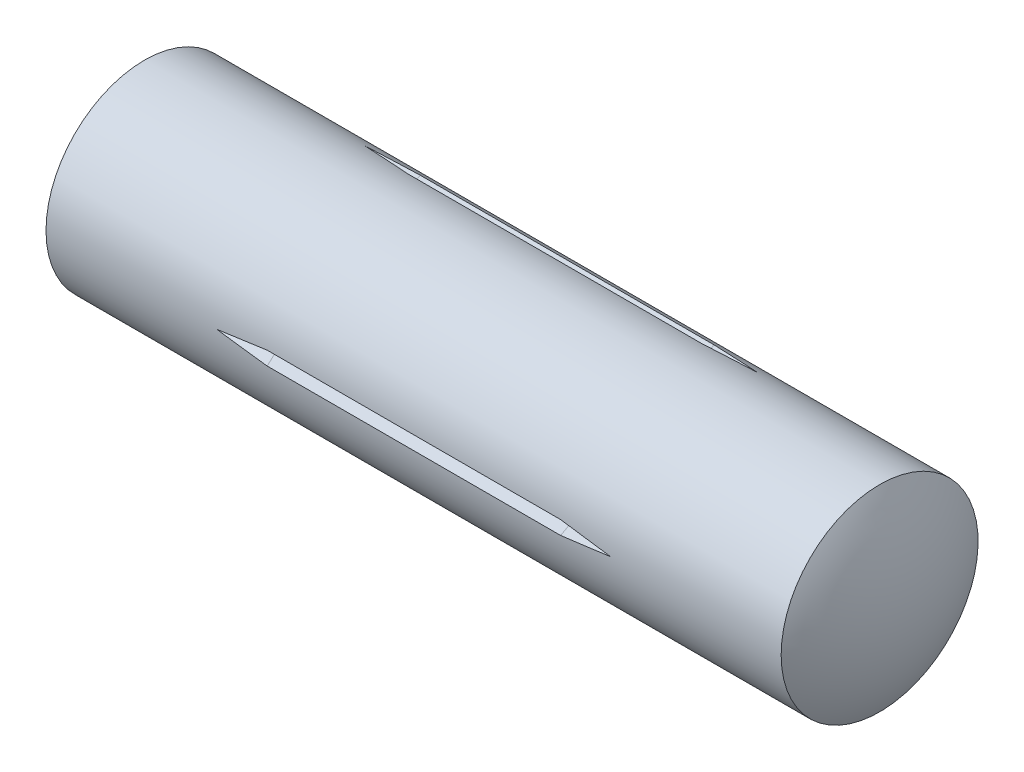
ISO-10303-21;
HEADER;
FILE_DESCRIPTION(('STEP AP214'),'2;1');
FILE_NAME('part.step','',(''),(''),'','','');
FILE_SCHEMA(('AUTOMOTIVE_DESIGN { 1 0 10303 214 1 1 1 1 }'));
ENDSEC;
DATA;
#1=APPLICATION_CONTEXT('core data for automotive mechanical design processes');
#2=APPLICATION_PROTOCOL_DEFINITION('international standard','automotive_design',2000,#1);
#3=PRODUCT_CONTEXT('',#1,'mechanical');
#4=PRODUCT('Part','Part','',(#3));
#5=PRODUCT_RELATED_PRODUCT_CATEGORY('part','',(#4));
#6=PRODUCT_DEFINITION_FORMATION('','',#4);
#7=PRODUCT_DEFINITION_CONTEXT('part definition',#1,'design');
#8=PRODUCT_DEFINITION('design','',#6,#7);
#9=PRODUCT_DEFINITION_SHAPE('','',#8);
#10=(LENGTH_UNIT() NAMED_UNIT(*) SI_UNIT(.MILLI.,.METRE.));
#11=(NAMED_UNIT(*) PLANE_ANGLE_UNIT() SI_UNIT($,.RADIAN.));
#12=(NAMED_UNIT(*) SI_UNIT($,.STERADIAN.) SOLID_ANGLE_UNIT());
#13=UNCERTAINTY_MEASURE_WITH_UNIT(LENGTH_MEASURE(1.E-05),#10,'distance_accuracy_value','');
#14=(GEOMETRIC_REPRESENTATION_CONTEXT(3) GLOBAL_UNCERTAINTY_ASSIGNED_CONTEXT((#13)) GLOBAL_UNIT_ASSIGNED_CONTEXT((#10,
#11,#12)) REPRESENTATION_CONTEXT('',''));
#15=CARTESIAN_POINT('',(0.,0.,0.));
#16=DIRECTION('',(0.,0.,1.));
#17=DIRECTION('',(1.,0.,0.));
#18=AXIS2_PLACEMENT_3D('',#15,#16,#17);
#19=CARTESIAN_POINT('',(-57.,0.,0.));
#20=DIRECTION('',(-1.,0.,0.));
#21=DIRECTION('',(0.,0.,1.));
#22=AXIS2_PLACEMENT_3D('',#19,#20,#21);
#23=CYLINDRICAL_SURFACE('',#22,12.5);
#24=CARTESIAN_POINT('',(-37.4999999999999,0.,0.));
#25=DIRECTION('',(-0.113967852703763,-0.0865878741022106,-0.989703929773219));
#26=DIRECTION('',(-0.993484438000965,0.00993295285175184,0.11353417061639));
#27=AXIS2_PLACEMENT_3D('',#24,#25,#26);
#28=ELLIPSE('',#27,109.68005190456,12.5);
#29=CARTESIAN_POINT('',(25.,-10.8253175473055,-6.25000000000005));
#30=VERTEX_POINT('',#29);
#31=CARTESIAN_POINT('',(18.6292333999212,-11.2344625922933,-5.48058849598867));
#32=VERTEX_POINT('',#31);
#33=EDGE_CURVE('E240',#30,#32,#28,.T.);
#34=ORIENTED_EDGE('',*,*,#33,.F.);
#35=CARTESIAN_POINT('',(-37.4999999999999,0.,0.));
#36=DIRECTION('',(-0.113967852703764,-0.900402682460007,0.419864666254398));
#37=DIRECTION('',(-0.993484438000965,0.103289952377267,-0.0481648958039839));
#38=AXIS2_PLACEMENT_3D('',#35,#36,#37);
#39=ELLIPSE('',#38,109.68005190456,12.5);
#40=CARTESIAN_POINT('',(18.6292333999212,-10.3635601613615,-6.9890357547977));
#41=VERTEX_POINT('',#40);
#42=EDGE_CURVE('E232',#41,#30,#39,.T.);
#43=ORIENTED_EDGE('',*,*,#42,.F.);
#44=DIRECTION('',(-1.,0.,0.));
#45=VECTOR('',#44,1.);
#46=CARTESIAN_POINT('',(-57.,-10.3635601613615,-6.9890357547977));
#47=LINE('',#46,#45);
#48=CARTESIAN_POINT('',(-18.6292333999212,-10.3635601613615,-6.98903575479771));
#49=VERTEX_POINT('',#48);
#50=EDGE_CURVE('E230',#41,#49,#47,.T.);
#51=ORIENTED_EDGE('',*,*,#50,.T.);
#52=CARTESIAN_POINT('',(37.4999999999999,0.,0.));
#53=DIRECTION('',(0.113967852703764,-0.900402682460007,0.419864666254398));
#54=DIRECTION('',(-0.993484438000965,-0.103289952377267,0.0481648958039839));
#55=AXIS2_PLACEMENT_3D('',#52,#53,#54);
#56=ELLIPSE('',#55,109.68005190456,12.5);
#57=CARTESIAN_POINT('',(-25.,-10.8253175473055,-6.25000000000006));
#58=VERTEX_POINT('',#57);
#59=EDGE_CURVE('E224',#58,#49,#56,.T.);
#60=ORIENTED_EDGE('',*,*,#59,.F.);
#61=CARTESIAN_POINT('',(37.4999999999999,0.,0.));
#62=DIRECTION('',(0.113967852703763,-0.0865878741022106,-0.989703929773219));
#63=DIRECTION('',(-0.993484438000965,-0.00993295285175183,-0.11353417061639));
#64=AXIS2_PLACEMENT_3D('',#61,#62,#63);
#65=ELLIPSE('',#64,109.68005190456,12.5);
#66=CARTESIAN_POINT('',(-18.6292333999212,-11.2344625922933,-5.48058849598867));
#67=VERTEX_POINT('',#66);
#68=EDGE_CURVE('E227',#67,#58,#65,.T.);
#69=ORIENTED_EDGE('',*,*,#68,.F.);
#70=DIRECTION('',(-1.,0.,0.));
#71=VECTOR('',#70,1.);
#72=CARTESIAN_POINT('',(-57.,-11.2344625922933,-5.48058849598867));
#73=LINE('',#72,#71);
#74=EDGE_CURVE('E235',#67,#32,#73,.F.);
#75=ORIENTED_EDGE('',*,*,#74,.T.);
#76=EDGE_LOOP('',(#34,#43,#51,#60,#69,#75));
#77=FACE_BOUND('',#76,.T.);
#78=CARTESIAN_POINT('',(46.6506350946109,0.,0.));
#79=DIRECTION('',(-1.,0.,0.));
#80=DIRECTION('',(0.,0.,1.));
#81=AXIS2_PLACEMENT_3D('',#78,#79,#80);
#82=CIRCLE('',#81,12.5);
#83=CARTESIAN_POINT('',(46.6506350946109,0.,12.5));
#84=VERTEX_POINT('',#83);
#85=EDGE_CURVE('E202',#84,#84,#82,.T.);
#86=ORIENTED_EDGE('',*,*,#85,.T.);
#87=EDGE_LOOP('',(#86));
#88=FACE_BOUND('',#87,.T.);
#89=CARTESIAN_POINT('',(-46.6819046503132,0.,0.));
#90=DIRECTION('',(-1.,0.,0.));
#91=DIRECTION('',(0.,0.,1.));
#92=AXIS2_PLACEMENT_3D('',#89,#90,#91);
#93=CIRCLE('',#92,12.5);
#94=CARTESIAN_POINT('',(-46.6819046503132,12.5,0.));
#95=VERTEX_POINT('',#94);
#96=EDGE_CURVE('E203',#95,#95,#93,.T.);
#97=ORIENTED_EDGE('',*,*,#96,.F.);
#98=EDGE_LOOP('',(#97));
#99=FACE_BOUND('',#98,.T.);
#100=CARTESIAN_POINT('',(-37.4999999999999,0.,0.));
#101=DIRECTION('',(-0.113967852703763,-0.81381480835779,0.569839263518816));
#102=DIRECTION('',(-0.993484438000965,0.0933569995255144,-0.0653692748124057));
#103=AXIS2_PLACEMENT_3D('',#100,#101,#102);
#104=ELLIPSE('',#103,109.68005190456,12.5);
#105=CARTESIAN_POINT('',(25.,0.,12.5));
#106=VERTEX_POINT('',#105);
#107=CARTESIAN_POINT('',(18.6292333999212,0.87090243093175,12.4696242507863));
#108=VERTEX_POINT('',#107);
#109=EDGE_CURVE('E221',#106,#108,#104,.T.);
#110=ORIENTED_EDGE('',*,*,#109,.F.);
#111=CARTESIAN_POINT('',(-37.4999999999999,0.,0.));
#112=DIRECTION('',(-0.113967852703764,0.81381480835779,0.569839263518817));
#113=DIRECTION('',(-0.993484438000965,-0.0933569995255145,-0.0653692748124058));
#114=AXIS2_PLACEMENT_3D('',#111,#112,#113);
#115=ELLIPSE('',#114,109.68005190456,12.5);
#116=CARTESIAN_POINT('',(18.6292333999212,-0.870902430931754,12.4696242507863));
#117=VERTEX_POINT('',#116);
#118=EDGE_CURVE('E223',#117,#106,#115,.T.);
#119=ORIENTED_EDGE('',*,*,#118,.F.);
#120=DIRECTION('',(-1.,0.,0.));
#121=VECTOR('',#120,1.);
#122=CARTESIAN_POINT('',(-57.,-0.870902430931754,12.4696242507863));
#123=LINE('',#122,#121);
#124=CARTESIAN_POINT('',(-18.6292333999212,-0.870902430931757,12.4696242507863));
#125=VERTEX_POINT('',#124);
#126=EDGE_CURVE('E215',#117,#125,#123,.T.);
#127=ORIENTED_EDGE('',*,*,#126,.T.);
#128=CARTESIAN_POINT('',(37.4999999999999,0.,0.));
#129=DIRECTION('',(0.113967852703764,0.813814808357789,0.569839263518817));
#130=DIRECTION('',(-0.993484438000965,0.0933569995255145,0.0653692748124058));
#131=AXIS2_PLACEMENT_3D('',#128,#129,#130);
#132=ELLIPSE('',#131,109.68005190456,12.5);
#133=CARTESIAN_POINT('',(-25.,0.,12.5));
#134=VERTEX_POINT('',#133);
#135=EDGE_CURVE('E208',#134,#125,#132,.T.);
#136=ORIENTED_EDGE('',*,*,#135,.F.);
#137=CARTESIAN_POINT('',(37.4999999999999,0.,0.));
#138=DIRECTION('',(0.113967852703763,-0.81381480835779,0.569839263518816));
#139=DIRECTION('',(-0.993484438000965,-0.0933569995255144,0.0653692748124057));
#140=AXIS2_PLACEMENT_3D('',#137,#138,#139);
#141=ELLIPSE('',#140,109.68005190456,12.5);
#142=CARTESIAN_POINT('',(-18.6292333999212,0.87090243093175,12.4696242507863));
#143=VERTEX_POINT('',#142);
#144=EDGE_CURVE('E212',#143,#134,#141,.T.);
#145=ORIENTED_EDGE('',*,*,#144,.F.);
#146=DIRECTION('',(-1.,0.,0.));
#147=VECTOR('',#146,1.);
#148=CARTESIAN_POINT('',(-57.,0.870902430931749,12.4696242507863));
#149=LINE('',#148,#147);
#150=EDGE_CURVE('E220',#143,#108,#149,.F.);
#151=ORIENTED_EDGE('',*,*,#150,.T.);
#152=EDGE_LOOP('',(#110,#119,#127,#136,#145,#151));
#153=FACE_BOUND('',#152,.T.);
#154=CARTESIAN_POINT('',(-37.4999999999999,0.,0.));
#155=DIRECTION('',(-0.113967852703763,0.900402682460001,0.419864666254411));
#156=DIRECTION('',(-0.993484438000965,-0.103289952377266,-0.0481648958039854));
#157=AXIS2_PLACEMENT_3D('',#154,#155,#156);
#158=ELLIPSE('',#157,109.68005190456,12.5);
#159=CARTESIAN_POINT('',(25.,10.8253175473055,-6.2499999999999));
#160=VERTEX_POINT('',#159);
#161=CARTESIAN_POINT('',(18.6292333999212,10.3635601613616,-6.98903575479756));
#162=VERTEX_POINT('',#161);
#163=EDGE_CURVE('E12',#160,#162,#158,.T.);
#164=ORIENTED_EDGE('',*,*,#163,.F.);
#165=CARTESIAN_POINT('',(-37.4999999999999,0.,0.));
#166=DIRECTION('',(-0.113967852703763,0.086587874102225,-0.989703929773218));
#167=DIRECTION('',(-0.993484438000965,-0.00993295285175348,0.11353417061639));
#168=AXIS2_PLACEMENT_3D('',#165,#166,#167);
#169=ELLIPSE('',#168,109.68005190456,12.5);
#170=CARTESIAN_POINT('',(18.6292333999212,11.2344625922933,-5.48058849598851));
#171=VERTEX_POINT('',#170);
#172=EDGE_CURVE('E52',#171,#160,#169,.T.);
#173=ORIENTED_EDGE('',*,*,#172,.F.);
#174=DIRECTION('',(-1.,0.,0.));
#175=VECTOR('',#174,1.);
#176=CARTESIAN_POINT('',(-57.,11.2344625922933,-5.48058849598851));
#177=LINE('',#176,#175);
#178=CARTESIAN_POINT('',(-18.6292333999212,11.2344625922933,-5.48058849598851));
#179=VERTEX_POINT('',#178);
#180=EDGE_CURVE('E241',#171,#179,#177,.T.);
#181=ORIENTED_EDGE('',*,*,#180,.T.);
#182=CARTESIAN_POINT('',(37.5,0.,0.));
#183=DIRECTION('',(0.113967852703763,0.086587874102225,-0.989703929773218));
#184=DIRECTION('',(-0.993484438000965,0.00993295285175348,-0.11353417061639));
#185=AXIS2_PLACEMENT_3D('',#182,#183,#184);
#186=ELLIPSE('',#185,109.68005190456,12.5);
#187=CARTESIAN_POINT('',(-25.,10.8253175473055,-6.2499999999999));
#188=VERTEX_POINT('',#187);
#189=EDGE_CURVE('E133',#188,#179,#186,.T.);
#190=ORIENTED_EDGE('',*,*,#189,.F.);
#191=CARTESIAN_POINT('',(37.4999999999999,0.,0.));
#192=DIRECTION('',(0.113967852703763,0.900402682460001,0.419864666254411));
#193=DIRECTION('',(-0.993484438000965,0.103289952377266,0.0481648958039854));
#194=AXIS2_PLACEMENT_3D('',#191,#192,#193);
#195=ELLIPSE('',#194,109.68005190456,12.5);
#196=CARTESIAN_POINT('',(-18.6292333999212,10.3635601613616,-6.98903575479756));
#197=VERTEX_POINT('',#196);
#198=EDGE_CURVE('E157',#197,#188,#195,.T.);
#199=ORIENTED_EDGE('',*,*,#198,.F.);
#200=DIRECTION('',(-1.,0.,0.));
#201=VECTOR('',#200,1.);
#202=CARTESIAN_POINT('',(-57.,10.3635601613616,-6.98903575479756));
#203=LINE('',#202,#201);
#204=EDGE_CURVE('E151',#197,#162,#203,.F.);
#205=ORIENTED_EDGE('',*,*,#204,.T.);
#206=EDGE_LOOP('',(#164,#173,#181,#190,#199,#205));
#207=FACE_BOUND('',#206,.T.);
#208=ADVANCED_FACE('F44',(#77,#88,#99,#153,#207),#23,.T.);
#209=CARTESIAN_POINT('',(-25.0312695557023,0.,0.));
#210=DIRECTION('',(-1.,0.,0.));
#211=DIRECTION('',(0.,1.,0.));
#212=AXIS2_PLACEMENT_3D('',#209,#210,#211);
#213=SPHERICAL_SURFACE('',#212,25.);
#214=CARTESIAN_POINT('',(-50.,0.,0.));
#215=DIRECTION('',(-1.,0.,0.));
#216=DIRECTION('',(0.,0.,1.));
#217=AXIS2_PLACEMENT_3D('',#214,#215,#216);
#218=CIRCLE('',#217,1.25);
#219=CARTESIAN_POINT('',(-50.,1.25000000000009,0.));
#220=VERTEX_POINT('',#219);
#221=EDGE_CURVE('E210',#220,#220,#218,.T.);
#222=CARTESIAN_POINT('',(-50.,1.25000000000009,0.));
#223=CARTESIAN_POINT('',(-49.9938336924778,1.37317333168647,0.));
#224=CARTESIAN_POINT('',(-49.9867558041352,1.49630102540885,0.));
#225=CARTESIAN_POINT('',(-49.9707787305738,1.74243819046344,0.));
#226=CARTESIAN_POINT('',(-49.9618795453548,1.86544766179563,0.));
#227=CARTESIAN_POINT('',(-49.942261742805,2.11132143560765,0.));
#228=CARTESIAN_POINT('',(-49.931543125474,2.23418573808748,0.));
#229=CARTESIAN_POINT('',(-49.9082888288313,2.47974226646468,0.));
#230=CARTESIAN_POINT('',(-49.8957531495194,2.60243449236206,0.));
#231=CARTESIAN_POINT('',(-49.8688674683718,2.84761999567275,0.));
#232=CARTESIAN_POINT('',(-49.854517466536,2.97011327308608,0.));
#233=CARTESIAN_POINT('',(-49.8240062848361,3.21487405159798,0.));
#234=CARTESIAN_POINT('',(-49.8078451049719,3.33714155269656,0.));
#235=CARTESIAN_POINT('',(-49.7737151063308,3.58142400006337,0.));
#236=CARTESIAN_POINT('',(-49.7557462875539,3.70343894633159,0.));
#237=CARTESIAN_POINT('',(-49.718004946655,3.94718956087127,0.));
#238=CARTESIAN_POINT('',(-49.698232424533,4.06892522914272,0.));
#239=CARTESIAN_POINT('',(-49.6568880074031,4.31209062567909,0.));
#240=CARTESIAN_POINT('',(-49.6353161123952,4.433520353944,0.));
#241=CARTESIAN_POINT('',(-49.5903776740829,4.67604727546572,0.));
#242=CARTESIAN_POINT('',(-49.5670111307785,4.79714446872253,0.));
#243=CARTESIAN_POINT('',(-49.5184885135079,5.03897979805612,0.));
#244=CARTESIAN_POINT('',(-49.4933324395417,5.15971793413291,0.));
#245=CARTESIAN_POINT('',(-49.4412362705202,5.40080870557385,0.));
#246=CARTESIAN_POINT('',(-49.414296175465,5.521161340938,0.));
#247=CARTESIAN_POINT('',(-49.3586378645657,5.76145475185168,0.));
#248=CARTESIAN_POINT('',(-49.3299196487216,5.8813955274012,0.));
#249=CARTESIAN_POINT('',(-49.2707113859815,6.12083894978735,0.));
#250=CARTESIAN_POINT('',(-49.2402213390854,6.24034159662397,0.));
#251=CARTESIAN_POINT('',(-49.1774760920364,6.47888258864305,0.));
#252=CARTESIAN_POINT('',(-49.1452208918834,6.59792093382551,0.));
#253=CARTESIAN_POINT('',(-49.078952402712,6.83550725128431,0.));
#254=CARTESIAN_POINT('',(-49.0449391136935,6.95405522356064,0.));
#255=CARTESIAN_POINT('',(-48.9751618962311,7.19063483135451,0.));
#256=CARTESIAN_POINT('',(-48.9393979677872,7.30866646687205,0.));
#257=CARTESIAN_POINT('',(-48.8661273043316,7.54418755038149,0.));
#258=CARTESIAN_POINT('',(-48.8286205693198,7.66167699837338,0.));
#259=CARTESIAN_POINT('',(-48.7518725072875,7.89608797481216,0.));
#260=CARTESIAN_POINT('',(-48.712631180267,8.01300950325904,0.));
#261=CARTESIAN_POINT('',(-48.6324225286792,8.24625903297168,0.));
#262=CARTESIAN_POINT('',(-48.5914552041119,8.36258703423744,0.));
#263=CARTESIAN_POINT('',(-48.5078035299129,8.59462403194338,0.));
#264=CARTESIAN_POINT('',(-48.4651191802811,8.71033302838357,0.));
#265=CARTESIAN_POINT('',(-48.3780428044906,8.94110667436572,0.));
#266=CARTESIAN_POINT('',(-48.3336507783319,9.05617132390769,0.));
#267=CARTESIAN_POINT('',(-48.2431687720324,9.28563107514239,0.));
#268=CARTESIAN_POINT('',(-48.1970787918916,9.40002617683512,0.));
#269=CARTESIAN_POINT('',(-48.1032109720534,9.62812177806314,0.));
#270=CARTESIAN_POINT('',(-48.055433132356,9.74182227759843,0.));
#271=CARTESIAN_POINT('',(-47.9582000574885,9.96850377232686,0.));
#272=CARTESIAN_POINT('',(-47.9087448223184,10.08148476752,0.));
#273=CARTESIAN_POINT('',(-47.8081677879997,10.3067025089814,0.));
#274=CARTESIAN_POINT('',(-47.7570459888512,10.4189392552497,0.));
#275=CARTESIAN_POINT('',(-47.653147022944,10.6426439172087,0.));
#276=CARTESIAN_POINT('',(-47.6003698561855,10.7541118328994,0.));
#277=CARTESIAN_POINT('',(-47.4931717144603,10.9762544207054,0.));
#278=CARTESIAN_POINT('',(-47.4387507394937,11.0869290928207,0.));
#279=CARTESIAN_POINT('',(-47.3282768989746,11.307460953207,0.));
#280=CARTESIAN_POINT('',(-47.272224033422,11.417318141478,0.));
#281=CARTESIAN_POINT('',(-47.1584986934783,11.6361909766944,0.));
#282=CARTESIAN_POINT('',(-47.1008262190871,11.7452066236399,0.));
#283=CARTESIAN_POINT('',(-46.9838742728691,11.9623724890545,0.));
#284=CARTESIAN_POINT('',(-46.9245948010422,12.0705227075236,0.));
#285=CARTESIAN_POINT('',(-46.8044419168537,12.2859340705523,0.));
#286=CARTESIAN_POINT('',(-46.743568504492,12.3931952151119,0.));
#287=CARTESIAN_POINT('',(-46.6819046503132,12.5,0.));
#288=B_SPLINE_CURVE_WITH_KNOTS('',3,(#222,#223,#224,#225,#226,#227,#228,#229,#230,#231,#232,
#233,#234,#235,#236,#237,#238,#239,#240,#241,#242,#243,#244,#245,#246,#247,#248,#249,#250,#251,
#252,#253,#254,#255,#256,#257,#258,#259,#260,#261,#262,#263,#264,#265,#266,#267,#268,#269,#270,
#271,#272,#273,#274,#275,#276,#277,#278,#279,#280,#281,#282,#283,#284,#285,#286,#287),
.UNSPECIFIED.,.F.,.F.,(4,2,2,2,2,2,2,2,2,2,2,2,2,2,2,2,2,2,2,2,2,2,2,2,2,2,2,2,2,2,2,2,4),(0.,
0.369979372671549,0.739958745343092,1.10993811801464,1.47991749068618,1.84989686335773,
2.21987623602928,2.58985560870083,2.95983498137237,3.32981435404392,3.69979372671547,
4.06977309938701,4.43975247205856,4.8097318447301,5.17971121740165,5.5496905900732,
5.91966996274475,6.28964933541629,6.65962870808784,7.02960808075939,7.39958745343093,
7.76956682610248,8.13954619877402,8.50952557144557,8.87950494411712,9.24948431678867,
9.61946368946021,9.98944306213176,10.3594224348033,10.7294018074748,11.0993811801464,
11.4693605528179,11.8393399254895),.UNSPECIFIED.);
#289=EDGE_CURVE('BSEAM50',#220,#95,#288,.T.);
#290=ORIENTED_EDGE('',*,*,#221,.F.);
#291=ORIENTED_EDGE('',*,*,#96,.T.);
#292=ORIENTED_EDGE('',*,*,#289,.T.);
#293=ORIENTED_EDGE('',*,*,#289,.F.);
#294=EDGE_LOOP('',(#290,#292,#291,#293));
#295=FACE_BOUND('',#294,.T.);
#296=ADVANCED_FACE('F50',(#295),#213,.T.);
#297=CARTESIAN_POINT('',(-50.,0.,0.));
#298=DIRECTION('',(1.,0.,0.));
#299=DIRECTION('',(0.,0.,-1.));
#300=AXIS2_PLACEMENT_3D('',#297,#298,#299);
#301=PLANE('',#300);
#302=ORIENTED_EDGE('',*,*,#221,.T.);
#303=EDGE_LOOP('',(#302));
#304=FACE_BOUND('',#303,.T.);
#305=ADVANCED_FACE('F258',(#304),#301,.F.);
#306=CARTESIAN_POINT('',(25.,0.,0.));
#307=DIRECTION('',(-1.,0.,0.));
#308=DIRECTION('',(0.,1.,0.));
#309=AXIS2_PLACEMENT_3D('',#306,#307,#308);
#310=SPHERICAL_SURFACE('',#309,25.);
#311=ORIENTED_EDGE('',*,*,#85,.F.);
#312=EDGE_LOOP('',(#311));
#313=FACE_BOUND('',#312,.T.);
#314=ADVANCED_FACE('F270',(#313),#310,.T.);
#315=CARTESIAN_POINT('',(18.5292343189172,1.59204091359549,13.4795169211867));
#316=DIRECTION('',(-0.113967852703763,-0.81381480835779,0.569839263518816));
#317=DIRECTION('',(0.,-0.573576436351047,-0.819152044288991));
#318=AXIS2_PLACEMENT_3D('',#315,#316,#317);
#319=PLANE('',#318);
#320=ORIENTED_EDGE('',*,*,#109,.T.);
#321=DIRECTION('',(0.0803231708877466,-0.579246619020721,-0.811185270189));
#322=VECTOR('',#321,1.);
#323=CARTESIAN_POINT('',(18.5292343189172,1.59204091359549,13.4795169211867));
#324=LINE('',#323,#322);
#325=CARTESIAN_POINT('',(18.75,0.,11.25));
#326=VERTEX_POINT('',#325);
#327=EDGE_CURVE('E189',#108,#326,#324,.T.);
#328=ORIENTED_EDGE('',*,*,#327,.T.);
#329=DIRECTION('',(0.98058067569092,0.,0.196116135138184));
#330=VECTOR('',#329,1.);
#331=CARTESIAN_POINT('',(18.75,0.,11.25));
#332=LINE('',#331,#330);
#333=EDGE_CURVE('E190',#326,#106,#332,.T.);
#334=ORIENTED_EDGE('',*,*,#333,.T.);
#335=EDGE_LOOP('',(#320,#328,#334));
#336=FACE_BOUND('',#335,.T.);
#337=ADVANCED_FACE('F267',(#336),#319,.T.);
#338=CARTESIAN_POINT('',(18.5292343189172,-1.59204091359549,13.4795169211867));
#339=DIRECTION('',(-0.113967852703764,0.81381480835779,0.569839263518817));
#340=DIRECTION('',(0.,-0.573576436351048,0.819152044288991));
#341=AXIS2_PLACEMENT_3D('',#338,#339,#340);
#342=PLANE('',#341);
#343=ORIENTED_EDGE('',*,*,#118,.T.);
#344=ORIENTED_EDGE('',*,*,#333,.F.);
#345=DIRECTION('',(-0.0803231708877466,-0.579246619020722,0.811185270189));
#346=VECTOR('',#345,1.);
#347=CARTESIAN_POINT('',(18.5292343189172,-1.59204091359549,13.4795169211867));
#348=LINE('',#347,#346);
#349=EDGE_CURVE('E183',#326,#117,#348,.T.);
#350=ORIENTED_EDGE('',*,*,#349,.T.);
#351=EDGE_LOOP('',(#343,#344,#350));
#352=FACE_BOUND('',#351,.T.);
#353=ADVANCED_FACE('F263',(#352),#342,.T.);
#354=CARTESIAN_POINT('',(-18.7714540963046,-0.154715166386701,11.033334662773));
#355=DIRECTION('',(0.,0.81381480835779,-0.581124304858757));
#356=DIRECTION('',(0.,0.581124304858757,0.81381480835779));
#357=AXIS2_PLACEMENT_3D('',#354,#355,#356);
#358=PLANE('',#357);
#359=DIRECTION('',(0.0803231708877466,0.579246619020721,0.811185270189));
#360=VECTOR('',#359,1.);
#361=CARTESIAN_POINT('',(-18.7714540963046,-0.154715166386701,11.033334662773));
#362=LINE('',#361,#360);
#363=CARTESIAN_POINT('',(-18.75,0.,11.25));
#364=VERTEX_POINT('',#363);
#365=EDGE_CURVE('E191',#364,#143,#362,.T.);
#366=ORIENTED_EDGE('',*,*,#365,.F.);
#367=DIRECTION('',(1.,0.,0.));
#368=VECTOR('',#367,1.);
#369=CARTESIAN_POINT('',(-18.75,0.,11.25));
#370=LINE('',#369,#368);
#371=EDGE_CURVE('E188',#364,#326,#370,.T.);
#372=ORIENTED_EDGE('',*,*,#371,.T.);
#373=ORIENTED_EDGE('',*,*,#327,.F.);
#374=ORIENTED_EDGE('',*,*,#150,.F.);
#375=EDGE_LOOP('',(#366,#372,#373,#374));
#376=FACE_BOUND('',#375,.T.);
#377=ADVANCED_FACE('F286',(#376),#358,.F.);
#378=CARTESIAN_POINT('',(-18.7714540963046,0.154715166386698,11.033334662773));
#379=DIRECTION('',(0.,-0.81381480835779,-0.581124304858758));
#380=DIRECTION('',(0.,0.581124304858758,-0.81381480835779));
#381=AXIS2_PLACEMENT_3D('',#378,#379,#380);
#382=PLANE('',#381);
#383=ORIENTED_EDGE('',*,*,#349,.F.);
#384=ORIENTED_EDGE('',*,*,#371,.F.);
#385=DIRECTION('',(-0.0803231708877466,0.579246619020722,-0.811185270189));
#386=VECTOR('',#385,1.);
#387=CARTESIAN_POINT('',(-18.7714540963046,0.154715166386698,11.033334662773));
#388=LINE('',#387,#386);
#389=EDGE_CURVE('E193',#125,#364,#388,.T.);
#390=ORIENTED_EDGE('',*,*,#389,.F.);
#391=ORIENTED_EDGE('',*,*,#126,.F.);
#392=EDGE_LOOP('',(#383,#384,#390,#391));
#393=FACE_BOUND('',#392,.T.);
#394=ADVANCED_FACE('F295',(#393),#382,.F.);
#395=CARTESIAN_POINT('',(-15.4892923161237,0.,10.5978584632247));
#396=DIRECTION('',(0.113967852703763,-0.81381480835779,0.569839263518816));
#397=DIRECTION('',(0.,-0.573576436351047,-0.819152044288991));
#398=AXIS2_PLACEMENT_3D('',#395,#396,#397);
#399=PLANE('',#398);
#400=ORIENTED_EDGE('',*,*,#144,.T.);
#401=DIRECTION('',(-0.98058067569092,0.,0.196116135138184));
#402=VECTOR('',#401,1.);
#403=CARTESIAN_POINT('',(-15.4892923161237,0.,10.5978584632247));
#404=LINE('',#403,#402);
#405=EDGE_CURVE('E182',#364,#134,#404,.T.);
#406=ORIENTED_EDGE('',*,*,#405,.F.);
#407=ORIENTED_EDGE('',*,*,#365,.T.);
#408=EDGE_LOOP('',(#400,#406,#407));
#409=FACE_BOUND('',#408,.T.);
#410=ADVANCED_FACE('F306',(#409),#399,.T.);
#411=CARTESIAN_POINT('',(-15.4892923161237,0.,10.5978584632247));
#412=DIRECTION('',(0.113967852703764,0.813814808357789,0.569839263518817));
#413=DIRECTION('',(0.,-0.573576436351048,0.819152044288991));
#414=AXIS2_PLACEMENT_3D('',#411,#412,#413);
#415=PLANE('',#414);
#416=ORIENTED_EDGE('',*,*,#135,.T.);
#417=ORIENTED_EDGE('',*,*,#389,.T.);
#418=ORIENTED_EDGE('',*,*,#405,.T.);
#419=EDGE_LOOP('',(#416,#417,#418));
#420=FACE_BOUND('',#419,.T.);
#421=ADVANCED_FACE('F308',(#420),#415,.T.);
#422=CARTESIAN_POINT('',(18.5295225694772,-12.466064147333,-5.36135527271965));
#423=DIRECTION('',(-0.113967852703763,-0.0865878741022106,-0.989703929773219));
#424=DIRECTION('',(-0.993435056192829,0.,0.114397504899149));
#425=AXIS2_PLACEMENT_3D('',#422,#423,#424);
#426=PLANE('',#425);
#427=ORIENTED_EDGE('',*,*,#33,.T.);
#428=DIRECTION('',(0.0803231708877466,0.992130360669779,-0.0960496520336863));
#429=VECTOR('',#428,1.);
#430=CARTESIAN_POINT('',(18.5295225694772,-12.466064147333,-5.36135527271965));
#431=LINE('',#430,#429);
#432=CARTESIAN_POINT('',(18.75,-9.74278579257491,-5.62500000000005));
#433=VERTEX_POINT('',#432);
#434=EDGE_CURVE('E167',#32,#433,#431,.T.);
#435=ORIENTED_EDGE('',*,*,#434,.T.);
#436=DIRECTION('',(0.98058067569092,-0.169841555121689,-0.0980580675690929));
#437=VECTOR('',#436,1.);
#438=CARTESIAN_POINT('',(18.75,-9.74278579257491,-5.62500000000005));
#439=LINE('',#438,#437);
#440=EDGE_CURVE('E169',#433,#30,#439,.T.);
#441=ORIENTED_EDGE('',*,*,#440,.T.);
#442=EDGE_LOOP('',(#427,#435,#441));
#443=FACE_BOUND('',#442,.T.);
#444=ADVANCED_FACE('F309',(#443),#426,.T.);
#445=CARTESIAN_POINT('',(18.5295225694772,-10.8761019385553,-8.11525060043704));
#446=DIRECTION('',(-0.113967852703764,-0.900402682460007,0.419864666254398));
#447=DIRECTION('',(0.,-0.422618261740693,-0.906307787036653));
#448=AXIS2_PLACEMENT_3D('',#445,#446,#447);
#449=PLANE('',#448);
#450=ORIENTED_EDGE('',*,*,#42,.T.);
#451=ORIENTED_EDGE('',*,*,#440,.F.);
#452=DIRECTION('',(-0.0803231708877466,-0.412883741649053,-0.907234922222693));
#453=VECTOR('',#452,1.);
#454=CARTESIAN_POINT('',(18.5295225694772,-10.8761019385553,-8.11525060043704));
#455=LINE('',#454,#453);
#456=EDGE_CURVE('E168',#433,#41,#455,.T.);
#457=ORIENTED_EDGE('',*,*,#456,.T.);
#458=EDGE_LOOP('',(#450,#451,#457));
#459=FACE_BOUND('',#458,.T.);
#460=ADVANCED_FACE('F314',(#459),#449,.T.);
#461=CARTESIAN_POINT('',(-18.7717461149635,-9.47418358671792,-5.65100378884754));
#462=DIRECTION('',(0.,0.0963610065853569,0.99534645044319));
#463=DIRECTION('',(0.,-0.99534645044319,0.0963610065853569));
#464=AXIS2_PLACEMENT_3D('',#461,#462,#463);
#465=PLANE('',#464);
#466=DIRECTION('',(0.0803231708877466,-0.992130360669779,0.0960496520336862));
#467=VECTOR('',#466,1.);
#468=CARTESIAN_POINT('',(-18.7717461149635,-9.47418358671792,-5.65100378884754));
#469=LINE('',#468,#467);
#470=CARTESIAN_POINT('',(-18.75,-9.74278579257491,-5.62500000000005));
#471=VERTEX_POINT('',#470);
#472=EDGE_CURVE('E173',#471,#67,#469,.T.);
#473=ORIENTED_EDGE('',*,*,#472,.F.);
#474=DIRECTION('',(1.,0.,0.));
#475=VECTOR('',#474,1.);
#476=CARTESIAN_POINT('',(-18.75,-9.74278579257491,-5.62500000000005));
#477=LINE('',#476,#475);
#478=EDGE_CURVE('E175',#471,#433,#477,.T.);
#479=ORIENTED_EDGE('',*,*,#478,.T.);
#480=ORIENTED_EDGE('',*,*,#434,.F.);
#481=ORIENTED_EDGE('',*,*,#74,.F.);
#482=EDGE_LOOP('',(#473,#479,#480,#481));
#483=FACE_BOUND('',#482,.T.);
#484=ADVANCED_FACE('F319',(#483),#465,.F.);
#485=CARTESIAN_POINT('',(-18.7717461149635,-9.63100463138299,-5.37938177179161));
#486=DIRECTION('',(0.,0.910175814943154,-0.414222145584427));
#487=DIRECTION('',(0.,0.414222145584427,0.910175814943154));
#488=AXIS2_PLACEMENT_3D('',#485,#486,#487);
#489=PLANE('',#488);
#490=ORIENTED_EDGE('',*,*,#456,.F.);
#491=ORIENTED_EDGE('',*,*,#478,.F.);
#492=DIRECTION('',(-0.0803231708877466,0.412883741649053,0.907234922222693));
#493=VECTOR('',#492,1.);
#494=CARTESIAN_POINT('',(-18.7717461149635,-9.63100463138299,-5.37938177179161));
#495=LINE('',#494,#493);
#496=EDGE_CURVE('E176',#49,#471,#495,.T.);
#497=ORIENTED_EDGE('',*,*,#496,.F.);
#498=ORIENTED_EDGE('',*,*,#50,.F.);
#499=EDGE_LOOP('',(#490,#491,#497,#498));
#500=FACE_BOUND('',#499,.T.);
#501=ADVANCED_FACE('F322',(#500),#489,.F.);
#502=CARTESIAN_POINT('',(-15.4449097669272,-9.17032737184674,-5.29449097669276));
#503=DIRECTION('',(0.113967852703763,-0.0865878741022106,-0.989703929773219));
#504=DIRECTION('',(-0.993435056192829,0.,-0.114397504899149));
#505=AXIS2_PLACEMENT_3D('',#502,#503,#504);
#506=PLANE('',#505);
#507=ORIENTED_EDGE('',*,*,#68,.T.);
#508=DIRECTION('',(-0.98058067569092,-0.169841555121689,-0.0980580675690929));
#509=VECTOR('',#508,1.);
#510=CARTESIAN_POINT('',(-15.4449097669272,-9.17032737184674,-5.29449097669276));
#511=LINE('',#510,#509);
#512=EDGE_CURVE('E70',#471,#58,#511,.T.);
#513=ORIENTED_EDGE('',*,*,#512,.F.);
#514=ORIENTED_EDGE('',*,*,#472,.T.);
#515=EDGE_LOOP('',(#507,#513,#514));
#516=FACE_BOUND('',#515,.T.);
#517=ADVANCED_FACE('F325',(#516),#506,.T.);
#518=CARTESIAN_POINT('',(-15.4449097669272,-9.17032737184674,-5.29449097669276));
#519=DIRECTION('',(0.113967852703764,-0.900402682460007,0.419864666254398));
#520=DIRECTION('',(0.,-0.422618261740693,-0.906307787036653));
#521=AXIS2_PLACEMENT_3D('',#518,#519,#520);
#522=PLANE('',#521);
#523=ORIENTED_EDGE('',*,*,#59,.T.);
#524=ORIENTED_EDGE('',*,*,#496,.T.);
#525=ORIENTED_EDGE('',*,*,#512,.T.);
#526=EDGE_LOOP('',(#523,#524,#525));
#527=FACE_BOUND('',#526,.T.);
#528=ADVANCED_FACE('F328',(#527),#522,.T.);
#529=CARTESIAN_POINT('',(18.5295225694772,10.8761019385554,-8.11525060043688));
#530=DIRECTION('',(-0.113967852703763,0.900402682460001,0.419864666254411));
#531=DIRECTION('',(0.,-0.422618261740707,0.906307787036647));
#532=AXIS2_PLACEMENT_3D('',#529,#530,#531);
#533=PLANE('',#532);
#534=ORIENTED_EDGE('',*,*,#163,.T.);
#535=DIRECTION('',(0.0803231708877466,-0.412883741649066,0.907234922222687));
#536=VECTOR('',#535,1.);
#537=CARTESIAN_POINT('',(18.5295225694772,10.8761019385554,-8.11525060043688));
#538=LINE('',#537,#536);
#539=CARTESIAN_POINT('',(18.75,9.74278579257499,-5.62499999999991));
#540=VERTEX_POINT('',#539);
#541=EDGE_CURVE('E148',#162,#540,#538,.T.);
#542=ORIENTED_EDGE('',*,*,#541,.T.);
#543=DIRECTION('',(0.98058067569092,0.16984155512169,-0.0980580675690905));
#544=VECTOR('',#543,1.);
#545=CARTESIAN_POINT('',(18.75,9.74278579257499,-5.62499999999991));
#546=LINE('',#545,#544);
#547=EDGE_CURVE('E161',#540,#160,#546,.T.);
#548=ORIENTED_EDGE('',*,*,#547,.T.);
#549=EDGE_LOOP('',(#534,#542,#548));
#550=FACE_BOUND('',#549,.T.);
#551=ADVANCED_FACE('F249',(#550),#533,.T.);
#552=CARTESIAN_POINT('',(18.5295225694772,12.4660641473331,-5.36135527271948));
#553=DIRECTION('',(-0.113967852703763,0.086587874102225,-0.989703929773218));
#554=DIRECTION('',(-0.993435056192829,0.,0.11439750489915));
#555=AXIS2_PLACEMENT_3D('',#552,#553,#554);
#556=PLANE('',#555);
#557=ORIENTED_EDGE('',*,*,#172,.T.);
#558=ORIENTED_EDGE('',*,*,#547,.F.);
#559=DIRECTION('',(-0.0803231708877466,0.992130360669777,0.0960496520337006));
#560=VECTOR('',#559,1.);
#561=CARTESIAN_POINT('',(18.5295225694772,12.4660641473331,-5.36135527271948));
#562=LINE('',#561,#560);
#563=EDGE_CURVE('E146',#540,#171,#562,.T.);
#564=ORIENTED_EDGE('',*,*,#563,.T.);
#565=EDGE_LOOP('',(#557,#558,#564));
#566=FACE_BOUND('',#565,.T.);
#567=ADVANCED_FACE('F246',(#566),#556,.T.);
#568=CARTESIAN_POINT('',(-18.7717461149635,9.63100463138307,-5.37938177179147));
#569=DIRECTION('',(0.,-0.910175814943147,-0.41422214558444));
#570=DIRECTION('',(0.,0.41422214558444,-0.910175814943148));
#571=AXIS2_PLACEMENT_3D('',#568,#569,#570);
#572=PLANE('',#571);
#573=DIRECTION('',(0.0803231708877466,0.412883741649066,-0.907234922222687));
#574=VECTOR('',#573,1.);
#575=CARTESIAN_POINT('',(-18.7717461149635,9.63100463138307,-5.37938177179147));
#576=LINE('',#575,#574);
#577=CARTESIAN_POINT('',(-18.75,9.74278579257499,-5.62499999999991));
#578=VERTEX_POINT('',#577);
#579=EDGE_CURVE('E137',#578,#197,#576,.T.);
#580=ORIENTED_EDGE('',*,*,#579,.F.);
#581=DIRECTION('',(1.,0.,0.));
#582=VECTOR('',#581,1.);
#583=CARTESIAN_POINT('',(-18.75,9.74278579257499,-5.62499999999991));
#584=LINE('',#583,#582);
#585=EDGE_CURVE('E136',#578,#540,#584,.T.);
#586=ORIENTED_EDGE('',*,*,#585,.T.);
#587=ORIENTED_EDGE('',*,*,#541,.F.);
#588=ORIENTED_EDGE('',*,*,#204,.F.);
#589=EDGE_LOOP('',(#580,#586,#587,#588));
#590=FACE_BOUND('',#589,.T.);
#591=ADVANCED_FACE('F154',(#590),#572,.F.);
#592=CARTESIAN_POINT('',(-18.7717461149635,9.474183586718,-5.65100378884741));
#593=DIRECTION('',(0.,-0.0963610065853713,0.995346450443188));
#594=DIRECTION('',(0.,-0.995346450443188,-0.0963610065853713));
#595=AXIS2_PLACEMENT_3D('',#592,#593,#594);
#596=PLANE('',#595);
#597=ORIENTED_EDGE('',*,*,#563,.F.);
#598=ORIENTED_EDGE('',*,*,#585,.F.);
#599=DIRECTION('',(-0.0803231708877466,-0.992130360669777,-0.0960496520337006));
#600=VECTOR('',#599,1.);
#601=CARTESIAN_POINT('',(-18.7717461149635,9.474183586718,-5.65100378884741));
#602=LINE('',#601,#600);
#603=EDGE_CURVE('E132',#179,#578,#602,.T.);
#604=ORIENTED_EDGE('',*,*,#603,.F.);
#605=ORIENTED_EDGE('',*,*,#180,.F.);
#606=EDGE_LOOP('',(#597,#598,#604,#605));
#607=FACE_BOUND('',#606,.T.);
#608=ADVANCED_FACE('F144',(#607),#596,.F.);
#609=CARTESIAN_POINT('',(-15.4449097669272,9.17032737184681,-5.29449097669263));
#610=DIRECTION('',(0.113967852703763,0.900402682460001,0.419864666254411));
#611=DIRECTION('',(0.,-0.422618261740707,0.906307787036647));
#612=AXIS2_PLACEMENT_3D('',#609,#610,#611);
#613=PLANE('',#612);
#614=ORIENTED_EDGE('',*,*,#198,.T.);
#615=DIRECTION('',(-0.98058067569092,0.16984155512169,-0.0980580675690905));
#616=VECTOR('',#615,1.);
#617=CARTESIAN_POINT('',(-15.4449097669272,9.17032737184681,-5.29449097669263));
#618=LINE('',#617,#616);
#619=EDGE_CURVE('E58',#578,#188,#618,.T.);
#620=ORIENTED_EDGE('',*,*,#619,.F.);
#621=ORIENTED_EDGE('',*,*,#579,.T.);
#622=EDGE_LOOP('',(#614,#620,#621));
#623=FACE_BOUND('',#622,.T.);
#624=ADVANCED_FACE('F156',(#623),#613,.T.);
#625=CARTESIAN_POINT('',(-15.4449097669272,9.17032737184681,-5.29449097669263));
#626=DIRECTION('',(0.113967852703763,0.086587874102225,-0.989703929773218));
#627=DIRECTION('',(-0.993435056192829,0.,-0.11439750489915));
#628=AXIS2_PLACEMENT_3D('',#625,#626,#627);
#629=PLANE('',#628);
#630=ORIENTED_EDGE('',*,*,#189,.T.);
#631=ORIENTED_EDGE('',*,*,#603,.T.);
#632=ORIENTED_EDGE('',*,*,#619,.T.);
#633=EDGE_LOOP('',(#630,#631,#632));
#634=FACE_BOUND('',#633,.T.);
#635=ADVANCED_FACE('F135',(#634),#629,.T.);
#636=CLOSED_SHELL('',(#208,#296,#305,#314,#337,#353,#377,#394,#410,#421,#444,#460,#484,#501,
#517,#528,#551,#567,#591,#608,#624,#635));
#637=MANIFOLD_SOLID_BREP('B2',#636);
#638=ADVANCED_BREP_SHAPE_REPRESENTATION('',(#18,#637),#14);
#639=SHAPE_DEFINITION_REPRESENTATION(#9,#638);
ENDSEC;
END-ISO-10303-21;
